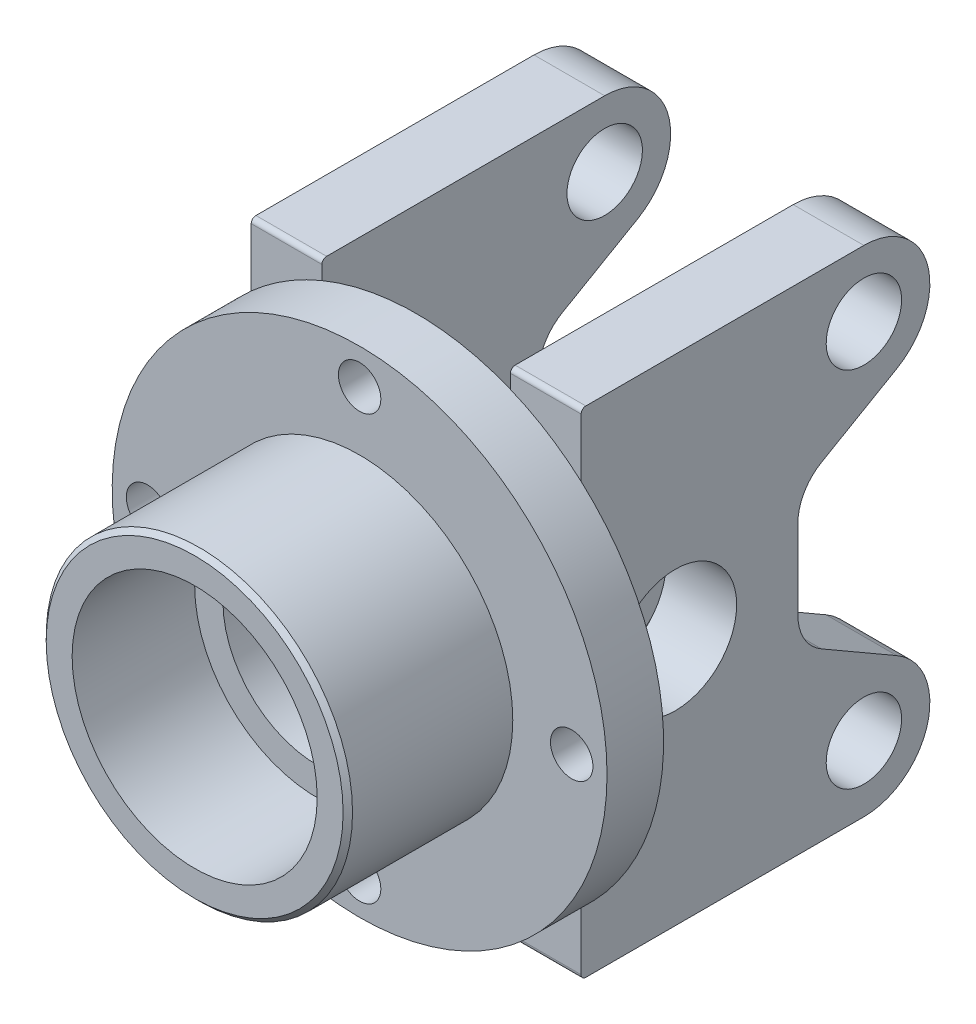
ISO-10303-21;
HEADER;
FILE_DESCRIPTION(('STEP AP214'),'2;1');
FILE_NAME('part.step','',(''),(''),'','','');
FILE_SCHEMA(('AUTOMOTIVE_DESIGN { 1 0 10303 214 1 1 1 1 }'));
ENDSEC;
DATA;
#1=APPLICATION_CONTEXT('core data for automotive mechanical design processes');
#2=APPLICATION_PROTOCOL_DEFINITION('international standard','automotive_design',2000,#1);
#3=PRODUCT_CONTEXT('',#1,'mechanical');
#4=PRODUCT('Part','Part','',(#3));
#5=PRODUCT_RELATED_PRODUCT_CATEGORY('part','',(#4));
#6=PRODUCT_DEFINITION_FORMATION('','',#4);
#7=PRODUCT_DEFINITION_CONTEXT('part definition',#1,'design');
#8=PRODUCT_DEFINITION('design','',#6,#7);
#9=PRODUCT_DEFINITION_SHAPE('','',#8);
#10=(LENGTH_UNIT() NAMED_UNIT(*) SI_UNIT(.MILLI.,.METRE.));
#11=(NAMED_UNIT(*) PLANE_ANGLE_UNIT() SI_UNIT($,.RADIAN.));
#12=(NAMED_UNIT(*) SI_UNIT($,.STERADIAN.) SOLID_ANGLE_UNIT());
#13=UNCERTAINTY_MEASURE_WITH_UNIT(LENGTH_MEASURE(1.E-05),#10,'distance_accuracy_value','');
#14=(GEOMETRIC_REPRESENTATION_CONTEXT(3) GLOBAL_UNCERTAINTY_ASSIGNED_CONTEXT((#13)) GLOBAL_UNIT_ASSIGNED_CONTEXT((#10,
#11,#12)) REPRESENTATION_CONTEXT('',''));
#15=CARTESIAN_POINT('',(0.,0.,0.));
#16=DIRECTION('',(0.,0.,1.));
#17=DIRECTION('',(1.,0.,0.));
#18=AXIS2_PLACEMENT_3D('',#15,#16,#17);
#19=CARTESIAN_POINT('',(35.,-52.5,-46.));
#20=DIRECTION('',(0.,1.,0.));
#21=DIRECTION('',(0.,0.,1.));
#22=AXIS2_PLACEMENT_3D('',#19,#20,#21);
#23=PLANE('',#22);
#24=DIRECTION('',(1.,0.,0.));
#25=VECTOR('',#24,1.);
#26=CARTESIAN_POINT('',(-32.1723616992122,-52.5,-60.));
#27=LINE('',#26,#25);
#28=CARTESIAN_POINT('',(-35.,-52.5,-60.));
#29=VERTEX_POINT('',#28);
#30=CARTESIAN_POINT('',(-20.,-52.5,-60.));
#31=VERTEX_POINT('',#30);
#32=EDGE_CURVE('E258',#29,#31,#27,.T.);
#33=ORIENTED_EDGE('',*,*,#32,.T.);
#34=DIRECTION('',(0.,0.,1.));
#35=VECTOR('',#34,1.);
#36=CARTESIAN_POINT('',(-20.,-52.5,-46.));
#37=LINE('',#36,#35);
#38=CARTESIAN_POINT('',(-20.,-52.5,-1.));
#39=VERTEX_POINT('',#38);
#40=EDGE_CURVE('E315',#31,#39,#37,.T.);
#41=ORIENTED_EDGE('',*,*,#40,.T.);
#42=DIRECTION('',(-1.,0.,0.));
#43=VECTOR('',#42,1.);
#44=CARTESIAN_POINT('',(-35.,-52.5,-1.));
#45=LINE('',#44,#43);
#46=CARTESIAN_POINT('',(-35.,-52.5,-1.));
#47=VERTEX_POINT('',#46);
#48=EDGE_CURVE('E391',#39,#47,#45,.T.);
#49=ORIENTED_EDGE('',*,*,#48,.T.);
#50=DIRECTION('',(0.,0.,1.));
#51=VECTOR('',#50,1.);
#52=CARTESIAN_POINT('',(-35.,-52.5,-46.));
#53=LINE('',#52,#51);
#54=EDGE_CURVE('E314',#29,#47,#53,.T.);
#55=ORIENTED_EDGE('',*,*,#54,.F.);
#56=EDGE_LOOP('',(#33,#41,#49,#55));
#57=FACE_BOUND('',#56,.T.);
#58=ADVANCED_FACE('F44',(#57),#23,.F.);
#59=CARTESIAN_POINT('',(35.,52.5,-46.));
#60=DIRECTION('',(0.,-1.,0.));
#61=DIRECTION('',(0.,0.,-1.));
#62=AXIS2_PLACEMENT_3D('',#59,#60,#61);
#63=PLANE('',#62);
#64=DIRECTION('',(0.,0.,1.));
#65=VECTOR('',#64,1.);
#66=CARTESIAN_POINT('',(-20.,52.5,-46.));
#67=LINE('',#66,#65);
#68=CARTESIAN_POINT('',(-20.,52.5,-60.));
#69=VERTEX_POINT('',#68);
#70=CARTESIAN_POINT('',(-20.,52.5,-1.));
#71=VERTEX_POINT('',#70);
#72=EDGE_CURVE('E307',#69,#71,#67,.T.);
#73=ORIENTED_EDGE('',*,*,#72,.F.);
#74=DIRECTION('',(1.,0.,0.));
#75=VECTOR('',#74,1.);
#76=CARTESIAN_POINT('',(-32.1723616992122,52.5,-60.));
#77=LINE('',#76,#75);
#78=CARTESIAN_POINT('',(-35.,52.5,-60.));
#79=VERTEX_POINT('',#78);
#80=EDGE_CURVE('E493',#79,#69,#77,.T.);
#81=ORIENTED_EDGE('',*,*,#80,.F.);
#82=DIRECTION('',(0.,0.,1.));
#83=VECTOR('',#82,1.);
#84=CARTESIAN_POINT('',(-35.,52.5,-46.));
#85=LINE('',#84,#83);
#86=CARTESIAN_POINT('',(-35.,52.5,-1.));
#87=VERTEX_POINT('',#86);
#88=EDGE_CURVE('E287',#79,#87,#85,.T.);
#89=ORIENTED_EDGE('',*,*,#88,.T.);
#90=DIRECTION('',(1.,0.,0.));
#91=VECTOR('',#90,1.);
#92=CARTESIAN_POINT('',(-20.,52.5,-1.));
#93=LINE('',#92,#91);
#94=EDGE_CURVE('E407',#87,#71,#93,.T.);
#95=ORIENTED_EDGE('',*,*,#94,.T.);
#96=EDGE_LOOP('',(#73,#81,#89,#95));
#97=FACE_BOUND('',#96,.T.);
#98=ADVANCED_FACE('F438',(#97),#63,.F.);
#99=CARTESIAN_POINT('',(-32.1723616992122,-38.5,-60.));
#100=DIRECTION('',(1.,0.,0.));
#101=DIRECTION('',(0.,1.,0.));
#102=AXIS2_PLACEMENT_3D('',#99,#100,#101);
#103=CYLINDRICAL_SURFACE('',#102,14.);
#104=DIRECTION('',(1.,0.,0.));
#105=VECTOR('',#104,1.);
#106=CARTESIAN_POINT('',(-32.1723616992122,-26.3756443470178,-67.));
#107=LINE('',#106,#105);
#108=CARTESIAN_POINT('',(-35.,-26.3756443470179,-67.));
#109=VERTEX_POINT('',#108);
#110=CARTESIAN_POINT('',(-20.,-26.3756443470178,-67.));
#111=VERTEX_POINT('',#110);
#112=EDGE_CURVE('E275',#109,#111,#107,.T.);
#113=ORIENTED_EDGE('',*,*,#112,.T.);
#114=CARTESIAN_POINT('',(-20.,-38.5,-60.));
#115=DIRECTION('',(-1.,0.,0.));
#116=DIRECTION('',(0.,0.,1.));
#117=AXIS2_PLACEMENT_3D('',#114,#115,#116);
#118=CIRCLE('',#117,14.);
#119=EDGE_CURVE('E547',#111,#31,#118,.T.);
#120=ORIENTED_EDGE('',*,*,#119,.T.);
#121=ORIENTED_EDGE('',*,*,#32,.F.);
#122=CARTESIAN_POINT('',(-35.,-38.5,-60.));
#123=DIRECTION('',(1.,0.,0.));
#124=DIRECTION('',(0.,1.,0.));
#125=AXIS2_PLACEMENT_3D('',#122,#123,#124);
#126=CIRCLE('',#125,14.);
#127=EDGE_CURVE('E507',#109,#29,#126,.F.);
#128=ORIENTED_EDGE('',*,*,#127,.F.);
#129=EDGE_LOOP('',(#113,#120,#121,#128));
#130=FACE_BOUND('',#129,.T.);
#131=ADVANCED_FACE('F435',(#130),#103,.T.);
#132=CARTESIAN_POINT('',(-32.1723616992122,-8.4777860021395,-56.));
#133=DIRECTION('',(1.,0.,0.));
#134=DIRECTION('',(0.,1.,0.));
#135=AXIS2_PLACEMENT_3D('',#132,#133,#134);
#136=CYLINDRICAL_SURFACE('',#135,10.);
#137=DIRECTION('',(-1.,0.,0.));
#138=VECTOR('',#137,1.);
#139=CARTESIAN_POINT('',(72.1723616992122,-8.4777860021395,-46.));
#140=LINE('',#139,#138);
#141=CARTESIAN_POINT('',(-20.,-8.47778600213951,-46.));
#142=VERTEX_POINT('',#141);
#143=CARTESIAN_POINT('',(-35.,-8.47778600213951,-46.));
#144=VERTEX_POINT('',#143);
#145=EDGE_CURVE('E503',#142,#144,#140,.T.);
#146=ORIENTED_EDGE('',*,*,#145,.F.);
#147=CARTESIAN_POINT('',(-20.,-8.47778600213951,-56.));
#148=DIRECTION('',(-1.,0.,0.));
#149=DIRECTION('',(0.,0.,1.));
#150=AXIS2_PLACEMENT_3D('',#147,#148,#149);
#151=CIRCLE('',#150,10.);
#152=CARTESIAN_POINT('',(-20.,-17.1380400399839,-51.));
#153=VERTEX_POINT('',#152);
#154=EDGE_CURVE('E62',#142,#153,#151,.F.);
#155=ORIENTED_EDGE('',*,*,#154,.T.);
#156=DIRECTION('',(1.,0.,0.));
#157=VECTOR('',#156,1.);
#158=CARTESIAN_POINT('',(-32.1723616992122,-17.1380400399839,-51.));
#159=LINE('',#158,#157);
#160=CARTESIAN_POINT('',(-35.,-17.1380400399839,-51.));
#161=VERTEX_POINT('',#160);
#162=EDGE_CURVE('E269',#161,#153,#159,.T.);
#163=ORIENTED_EDGE('',*,*,#162,.F.);
#164=CARTESIAN_POINT('',(-35.,-8.47778600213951,-56.));
#165=DIRECTION('',(1.,0.,0.));
#166=DIRECTION('',(0.,1.,0.));
#167=AXIS2_PLACEMENT_3D('',#164,#165,#166);
#168=CIRCLE('',#167,10.);
#169=EDGE_CURVE('E512',#144,#161,#168,.T.);
#170=ORIENTED_EDGE('',*,*,#169,.F.);
#171=EDGE_LOOP('',(#146,#155,#163,#170));
#172=FACE_BOUND('',#171,.T.);
#173=ADVANCED_FACE('F715',(#172),#136,.F.);
#174=CARTESIAN_POINT('',(-32.1723616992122,9.23011776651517,-5.32901097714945));
#175=DIRECTION('',(0.,0.86602540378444,-0.499999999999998));
#176=DIRECTION('',(0.,0.499999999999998,0.86602540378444));
#177=AXIS2_PLACEMENT_3D('',#174,#175,#176);
#178=PLANE('',#177);
#179=DIRECTION('',(0.,0.499999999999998,0.86602540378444));
#180=VECTOR('',#179,1.);
#181=CARTESIAN_POINT('',(-20.,9.23011776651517,-5.32901097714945));
#182=LINE('',#181,#180);
#183=EDGE_CURVE('E550',#111,#153,#182,.T.);
#184=ORIENTED_EDGE('',*,*,#183,.F.);
#185=ORIENTED_EDGE('',*,*,#112,.F.);
#186=DIRECTION('',(0.,0.499999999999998,0.86602540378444));
#187=VECTOR('',#186,1.);
#188=CARTESIAN_POINT('',(-35.,9.23011776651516,-5.32901097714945));
#189=LINE('',#188,#187);
#190=EDGE_CURVE('E510',#109,#161,#189,.T.);
#191=ORIENTED_EDGE('',*,*,#190,.T.);
#192=ORIENTED_EDGE('',*,*,#162,.T.);
#193=EDGE_LOOP('',(#184,#185,#191,#192));
#194=FACE_BOUND('',#193,.T.);
#195=ADVANCED_FACE('F713',(#194),#178,.T.);
#196=CARTESIAN_POINT('',(-32.1723616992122,-38.5,-60.));
#197=DIRECTION('',(1.,0.,0.));
#198=DIRECTION('',(0.,1.,0.));
#199=AXIS2_PLACEMENT_3D('',#196,#197,#198);
#200=CYLINDRICAL_SURFACE('',#199,8.00000000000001);
#201=CARTESIAN_POINT('',(-20.,-38.5,-60.));
#202=DIRECTION('',(-1.,0.,0.));
#203=DIRECTION('',(0.,0.,1.));
#204=AXIS2_PLACEMENT_3D('',#201,#202,#203);
#205=CIRCLE('',#204,8.00000000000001);
#206=CARTESIAN_POINT('',(-20.,-38.5,-52.));
#207=VERTEX_POINT('',#206);
#208=EDGE_CURVE('E520',#207,#207,#205,.T.);
#209=ORIENTED_EDGE('',*,*,#208,.F.);
#210=EDGE_LOOP('',(#209));
#211=FACE_BOUND('',#210,.T.);
#212=CARTESIAN_POINT('',(-35.,-38.5,-60.));
#213=DIRECTION('',(1.,0.,0.));
#214=DIRECTION('',(0.,1.,0.));
#215=AXIS2_PLACEMENT_3D('',#212,#213,#214);
#216=CIRCLE('',#215,8.00000000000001);
#217=CARTESIAN_POINT('',(-35.,-30.5,-60.));
#218=VERTEX_POINT('',#217);
#219=EDGE_CURVE('E506',#218,#218,#216,.F.);
#220=ORIENTED_EDGE('',*,*,#219,.T.);
#221=EDGE_LOOP('',(#220));
#222=FACE_BOUND('',#221,.T.);
#223=ADVANCED_FACE('F949',(#211,#222),#200,.F.);
#224=CARTESIAN_POINT('',(-32.1723616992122,38.5,-60.));
#225=DIRECTION('',(1.,0.,0.));
#226=DIRECTION('',(0.,1.,0.));
#227=AXIS2_PLACEMENT_3D('',#224,#225,#226);
#228=CYLINDRICAL_SURFACE('',#227,14.);
#229=CARTESIAN_POINT('',(-20.,38.5,-60.));
#230=DIRECTION('',(-1.,0.,0.));
#231=DIRECTION('',(0.,0.,1.));
#232=AXIS2_PLACEMENT_3D('',#229,#230,#231);
#233=CIRCLE('',#232,14.);
#234=CARTESIAN_POINT('',(-20.,26.3756443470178,-67.));
#235=VERTEX_POINT('',#234);
#236=EDGE_CURVE('E536',#235,#69,#233,.F.);
#237=ORIENTED_EDGE('',*,*,#236,.F.);
#238=DIRECTION('',(1.,0.,0.));
#239=VECTOR('',#238,1.);
#240=CARTESIAN_POINT('',(-32.1723616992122,26.3756443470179,-67.));
#241=LINE('',#240,#239);
#242=CARTESIAN_POINT('',(-35.,26.3756443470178,-67.));
#243=VERTEX_POINT('',#242);
#244=EDGE_CURVE('E488',#243,#235,#241,.T.);
#245=ORIENTED_EDGE('',*,*,#244,.F.);
#246=CARTESIAN_POINT('',(-35.,38.5,-60.));
#247=DIRECTION('',(1.,0.,0.));
#248=DIRECTION('',(0.,1.,0.));
#249=AXIS2_PLACEMENT_3D('',#246,#247,#248);
#250=CIRCLE('',#249,14.);
#251=EDGE_CURVE('E528',#243,#79,#250,.T.);
#252=ORIENTED_EDGE('',*,*,#251,.T.);
#253=ORIENTED_EDGE('',*,*,#80,.T.);
#254=EDGE_LOOP('',(#237,#245,#252,#253));
#255=FACE_BOUND('',#254,.T.);
#256=ADVANCED_FACE('F707',(#255),#228,.T.);
#257=CARTESIAN_POINT('',(-32.1723616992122,-9.23011776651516,-5.32901097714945));
#258=DIRECTION('',(0.,0.86602540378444,0.499999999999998));
#259=DIRECTION('',(0.,-0.499999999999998,0.86602540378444));
#260=AXIS2_PLACEMENT_3D('',#257,#258,#259);
#261=PLANE('',#260);
#262=ORIENTED_EDGE('',*,*,#244,.T.);
#263=DIRECTION('',(0.,-0.499999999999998,0.86602540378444));
#264=VECTOR('',#263,1.);
#265=CARTESIAN_POINT('',(-20.,-9.23011776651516,-5.32901097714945));
#266=LINE('',#265,#264);
#267=CARTESIAN_POINT('',(-20.,17.1380400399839,-51.));
#268=VERTEX_POINT('',#267);
#269=EDGE_CURVE('E545',#235,#268,#266,.T.);
#270=ORIENTED_EDGE('',*,*,#269,.T.);
#271=DIRECTION('',(1.,0.,0.));
#272=VECTOR('',#271,1.);
#273=CARTESIAN_POINT('',(-32.1723616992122,17.1380400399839,-51.));
#274=LINE('',#273,#272);
#275=CARTESIAN_POINT('',(-35.,17.1380400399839,-51.));
#276=VERTEX_POINT('',#275);
#277=EDGE_CURVE('E481',#276,#268,#274,.T.);
#278=ORIENTED_EDGE('',*,*,#277,.F.);
#279=DIRECTION('',(0.,-0.499999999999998,0.86602540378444));
#280=VECTOR('',#279,1.);
#281=CARTESIAN_POINT('',(-35.,-9.23011776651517,-5.32901097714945));
#282=LINE('',#281,#280);
#283=EDGE_CURVE('E526',#243,#276,#282,.T.);
#284=ORIENTED_EDGE('',*,*,#283,.F.);
#285=EDGE_LOOP('',(#262,#270,#278,#284));
#286=FACE_BOUND('',#285,.T.);
#287=ADVANCED_FACE('F604',(#286),#261,.F.);
#288=CARTESIAN_POINT('',(-32.1723616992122,38.5,-60.));
#289=DIRECTION('',(1.,0.,0.));
#290=DIRECTION('',(0.,1.,0.));
#291=AXIS2_PLACEMENT_3D('',#288,#289,#290);
#292=CYLINDRICAL_SURFACE('',#291,8.00000000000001);
#293=CARTESIAN_POINT('',(-20.,38.5,-60.));
#294=DIRECTION('',(-1.,0.,0.));
#295=DIRECTION('',(0.,0.,1.));
#296=AXIS2_PLACEMENT_3D('',#293,#294,#295);
#297=CIRCLE('',#296,8.00000000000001);
#298=CARTESIAN_POINT('',(-20.,38.5,-52.));
#299=VERTEX_POINT('',#298);
#300=EDGE_CURVE('E537',#299,#299,#297,.F.);
#301=ORIENTED_EDGE('',*,*,#300,.T.);
#302=EDGE_LOOP('',(#301));
#303=FACE_BOUND('',#302,.T.);
#304=CARTESIAN_POINT('',(-35.,38.5,-60.));
#305=DIRECTION('',(1.,0.,0.));
#306=DIRECTION('',(0.,1.,0.));
#307=AXIS2_PLACEMENT_3D('',#304,#305,#306);
#308=CIRCLE('',#307,8.00000000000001);
#309=CARTESIAN_POINT('',(-35.,46.5,-60.));
#310=VERTEX_POINT('',#309);
#311=EDGE_CURVE('E511',#310,#310,#308,.T.);
#312=ORIENTED_EDGE('',*,*,#311,.F.);
#313=EDGE_LOOP('',(#312));
#314=FACE_BOUND('',#313,.T.);
#315=ADVANCED_FACE('F591',(#303,#314),#292,.F.);
#316=CARTESIAN_POINT('',(-32.1723616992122,8.47778600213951,-56.));
#317=DIRECTION('',(1.,0.,0.));
#318=DIRECTION('',(0.,1.,0.));
#319=AXIS2_PLACEMENT_3D('',#316,#317,#318);
#320=CYLINDRICAL_SURFACE('',#319,10.);
#321=CARTESIAN_POINT('',(-20.,8.47778600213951,-56.));
#322=DIRECTION('',(-1.,0.,0.));
#323=DIRECTION('',(0.,0.,1.));
#324=AXIS2_PLACEMENT_3D('',#321,#322,#323);
#325=CIRCLE('',#324,10.);
#326=CARTESIAN_POINT('',(-20.,8.4777860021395,-46.));
#327=VERTEX_POINT('',#326);
#328=EDGE_CURVE('E542',#327,#268,#325,.T.);
#329=ORIENTED_EDGE('',*,*,#328,.F.);
#330=DIRECTION('',(-1.,0.,0.));
#331=VECTOR('',#330,1.);
#332=CARTESIAN_POINT('',(72.1723616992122,8.47778600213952,-46.));
#333=LINE('',#332,#331);
#334=CARTESIAN_POINT('',(-35.,8.4777860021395,-46.));
#335=VERTEX_POINT('',#334);
#336=EDGE_CURVE('E518',#327,#335,#333,.T.);
#337=ORIENTED_EDGE('',*,*,#336,.T.);
#338=CARTESIAN_POINT('',(-35.,8.4777860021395,-56.));
#339=DIRECTION('',(1.,0.,0.));
#340=DIRECTION('',(0.,1.,0.));
#341=AXIS2_PLACEMENT_3D('',#338,#339,#340);
#342=CIRCLE('',#341,10.);
#343=EDGE_CURVE('E521',#335,#276,#342,.F.);
#344=ORIENTED_EDGE('',*,*,#343,.T.);
#345=ORIENTED_EDGE('',*,*,#277,.T.);
#346=EDGE_LOOP('',(#329,#337,#344,#345));
#347=FACE_BOUND('',#346,.T.);
#348=ADVANCED_FACE('F583',(#347),#320,.F.);
#349=CARTESIAN_POINT('',(0.,0.,-46.));
#350=DIRECTION('',(0.,0.,1.));
#351=DIRECTION('',(1.,0.,0.));
#352=AXIS2_PLACEMENT_3D('',#349,#350,#351);
#353=PLANE('',#352);
#354=ORIENTED_EDGE('',*,*,#336,.F.);
#355=DIRECTION('',(0.,-1.,0.));
#356=VECTOR('',#355,1.);
#357=CARTESIAN_POINT('',(-20.,52.5,-46.));
#358=LINE('',#357,#356);
#359=EDGE_CURVE('E319',#327,#142,#358,.T.);
#360=ORIENTED_EDGE('',*,*,#359,.T.);
#361=ORIENTED_EDGE('',*,*,#145,.T.);
#362=DIRECTION('',(0.,1.,0.));
#363=VECTOR('',#362,1.);
#364=CARTESIAN_POINT('',(-35.,52.5,-46.));
#365=LINE('',#364,#363);
#366=EDGE_CURVE('E326',#144,#335,#365,.T.);
#367=ORIENTED_EDGE('',*,*,#366,.T.);
#368=EDGE_LOOP('',(#354,#360,#361,#367));
#369=FACE_BOUND('',#368,.T.);
#370=ADVANCED_FACE('F593',(#369),#353,.F.);
#371=CARTESIAN_POINT('',(0.,0.,0.));
#372=DIRECTION('',(0.,0.,1.));
#373=DIRECTION('',(1.,0.,0.));
#374=AXIS2_PLACEMENT_3D('',#371,#372,#373);
#375=PLANE('',#374);
#376=CARTESIAN_POINT('',(45.,4.71349980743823E-13,0.));
#377=DIRECTION('',(0.,0.,-1.));
#378=DIRECTION('',(-1.,0.,0.));
#379=AXIS2_PLACEMENT_3D('',#376,#377,#378);
#380=CIRCLE('',#379,4.5);
#381=CARTESIAN_POINT('',(40.5,4.71349980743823E-13,0.));
#382=VERTEX_POINT('',#381);
#383=EDGE_CURVE('E306',#382,#382,#380,.T.);
#384=ORIENTED_EDGE('',*,*,#383,.F.);
#385=EDGE_LOOP('',(#384));
#386=FACE_BOUND('',#385,.T.);
#387=DIRECTION('',(0.,-1.,0.));
#388=VECTOR('',#387,1.);
#389=CARTESIAN_POINT('',(35.,52.5,0.));
#390=LINE('',#389,#388);
#391=CARTESIAN_POINT('',(35.,39.1311896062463,0.));
#392=VERTEX_POINT('',#391);
#393=CARTESIAN_POINT('',(35.,-39.1311896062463,0.));
#394=VERTEX_POINT('',#393);
#395=EDGE_CURVE('E295',#392,#394,#390,.T.);
#396=ORIENTED_EDGE('',*,*,#395,.F.);
#397=CARTESIAN_POINT('',(0.,0.,0.));
#398=DIRECTION('',(0.,0.,1.));
#399=DIRECTION('',(1.,0.,0.));
#400=AXIS2_PLACEMENT_3D('',#397,#398,#399);
#401=CIRCLE('',#400,52.5);
#402=EDGE_CURVE('E367',#394,#392,#401,.T.);
#403=ORIENTED_EDGE('',*,*,#402,.F.);
#404=EDGE_LOOP('',(#396,#403));
#405=FACE_BOUND('',#404,.T.);
#406=ADVANCED_FACE('F598',(#386,#405),#375,.F.);
#407=CARTESIAN_POINT('',(3.14233320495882E-13,-45.,0.));
#408=DIRECTION('',(0.,0.,-1.));
#409=DIRECTION('',(-1.,0.,0.));
#410=AXIS2_PLACEMENT_3D('',#407,#408,#409);
#411=CIRCLE('',#410,4.5);
#412=CARTESIAN_POINT('',(-4.49999999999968,-45.,0.));
#413=VERTEX_POINT('',#412);
#414=EDGE_CURVE('E340',#413,#413,#411,.T.);
#415=ORIENTED_EDGE('',*,*,#414,.F.);
#416=EDGE_LOOP('',(#415));
#417=FACE_BOUND('',#416,.T.);
#418=DIRECTION('',(0.,1.,0.));
#419=VECTOR('',#418,1.);
#420=CARTESIAN_POINT('',(20.,52.5,0.));
#421=LINE('',#420,#419);
#422=CARTESIAN_POINT('',(20.,-48.541219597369,0.));
#423=VERTEX_POINT('',#422);
#424=CARTESIAN_POINT('',(20.,0.,0.));
#425=VERTEX_POINT('',#424);
#426=EDGE_CURVE('E750',#423,#425,#421,.T.);
#427=ORIENTED_EDGE('',*,*,#426,.F.);
#428=CARTESIAN_POINT('',(-20.,-48.541219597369,0.));
#429=VERTEX_POINT('',#428);
#430=EDGE_CURVE('E728',#429,#423,#401,.T.);
#431=ORIENTED_EDGE('',*,*,#430,.F.);
#432=DIRECTION('',(0.,-1.,0.));
#433=VECTOR('',#432,1.);
#434=CARTESIAN_POINT('',(-20.,52.5,0.));
#435=LINE('',#434,#433);
#436=CARTESIAN_POINT('',(-20.,0.,0.));
#437=VERTEX_POINT('',#436);
#438=EDGE_CURVE('E324',#437,#429,#435,.T.);
#439=ORIENTED_EDGE('',*,*,#438,.F.);
#440=CARTESIAN_POINT('',(0.,0.,0.));
#441=DIRECTION('',(0.,0.,-1.));
#442=DIRECTION('',(-1.,0.,0.));
#443=AXIS2_PLACEMENT_3D('',#440,#441,#442);
#444=CIRCLE('',#443,20.);
#445=EDGE_CURVE('E354',#425,#437,#444,.T.);
#446=ORIENTED_EDGE('',*,*,#445,.F.);
#447=EDGE_LOOP('',(#427,#431,#439,#446));
#448=FACE_BOUND('',#447,.T.);
#449=ADVANCED_FACE('F676',(#417,#448),#375,.F.);
#450=CARTESIAN_POINT('',(0.,45.,0.));
#451=DIRECTION('',(0.,0.,-1.));
#452=DIRECTION('',(-1.,0.,0.));
#453=AXIS2_PLACEMENT_3D('',#450,#451,#452);
#454=CIRCLE('',#453,4.5);
#455=CARTESIAN_POINT('',(-4.5,45.,0.));
#456=VERTEX_POINT('',#455);
#457=EDGE_CURVE('E327',#456,#456,#454,.T.);
#458=ORIENTED_EDGE('',*,*,#457,.F.);
#459=EDGE_LOOP('',(#458));
#460=FACE_BOUND('',#459,.T.);
#461=CARTESIAN_POINT('',(20.,48.541219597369,0.));
#462=VERTEX_POINT('',#461);
#463=EDGE_CURVE('E298',#425,#462,#421,.T.);
#464=ORIENTED_EDGE('',*,*,#463,.F.);
#465=EDGE_CURVE('E356',#437,#425,#444,.T.);
#466=ORIENTED_EDGE('',*,*,#465,.F.);
#467=CARTESIAN_POINT('',(-20.,48.541219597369,0.));
#468=VERTEX_POINT('',#467);
#469=EDGE_CURVE('E752',#468,#437,#435,.T.);
#470=ORIENTED_EDGE('',*,*,#469,.F.);
#471=EDGE_CURVE('E374',#462,#468,#401,.T.);
#472=ORIENTED_EDGE('',*,*,#471,.F.);
#473=EDGE_LOOP('',(#464,#466,#470,#472));
#474=FACE_BOUND('',#473,.T.);
#475=ADVANCED_FACE('F761',(#460,#474),#375,.F.);
#476=CARTESIAN_POINT('',(-45.,-1.57116660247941E-13,0.));
#477=DIRECTION('',(0.,0.,-1.));
#478=DIRECTION('',(-1.,0.,0.));
#479=AXIS2_PLACEMENT_3D('',#476,#477,#478);
#480=CIRCLE('',#479,4.5);
#481=CARTESIAN_POINT('',(-49.5,-1.57116660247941E-13,0.));
#482=VERTEX_POINT('',#481);
#483=EDGE_CURVE('E333',#482,#482,#480,.T.);
#484=ORIENTED_EDGE('',*,*,#483,.F.);
#485=EDGE_LOOP('',(#484));
#486=FACE_BOUND('',#485,.T.);
#487=DIRECTION('',(0.,1.,0.));
#488=VECTOR('',#487,1.);
#489=CARTESIAN_POINT('',(-35.,52.5,0.));
#490=LINE('',#489,#488);
#491=CARTESIAN_POINT('',(-35.,-39.1311896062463,0.));
#492=VERTEX_POINT('',#491);
#493=CARTESIAN_POINT('',(-35.,39.1311896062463,0.));
#494=VERTEX_POINT('',#493);
#495=EDGE_CURVE('E328',#492,#494,#490,.T.);
#496=ORIENTED_EDGE('',*,*,#495,.F.);
#497=EDGE_CURVE('E729',#494,#492,#401,.T.);
#498=ORIENTED_EDGE('',*,*,#497,.F.);
#499=EDGE_LOOP('',(#496,#498));
#500=FACE_BOUND('',#499,.T.);
#501=ADVANCED_FACE('F679',(#486,#500),#375,.F.);
#502=CARTESIAN_POINT('',(0.,0.,12.));
#503=DIRECTION('',(0.,0.,-1.));
#504=DIRECTION('',(-1.,0.,0.));
#505=AXIS2_PLACEMENT_3D('',#502,#503,#504);
#506=CYLINDRICAL_SURFACE('',#505,52.5);
#507=CARTESIAN_POINT('',(0.,0.,12.));
#508=DIRECTION('',(0.,0.,1.));
#509=DIRECTION('',(1.,0.,0.));
#510=AXIS2_PLACEMENT_3D('',#507,#508,#509);
#511=CIRCLE('',#510,52.5);
#512=CARTESIAN_POINT('',(52.5,0.,12.));
#513=VERTEX_POINT('',#512);
#514=EDGE_CURVE('E369',#513,#513,#511,.T.);
#515=ORIENTED_EDGE('',*,*,#514,.F.);
#516=EDGE_LOOP('',(#515));
#517=FACE_BOUND('',#516,.T.);
#518=EDGE_CURVE('E373',#392,#462,#401,.T.);
#519=ORIENTED_EDGE('',*,*,#518,.T.);
#520=ORIENTED_EDGE('',*,*,#471,.T.);
#521=EDGE_CURVE('E732',#468,#494,#401,.T.);
#522=ORIENTED_EDGE('',*,*,#521,.T.);
#523=ORIENTED_EDGE('',*,*,#497,.T.);
#524=EDGE_CURVE('E723',#492,#429,#401,.T.);
#525=ORIENTED_EDGE('',*,*,#524,.T.);
#526=ORIENTED_EDGE('',*,*,#430,.T.);
#527=EDGE_CURVE('E735',#423,#394,#401,.T.);
#528=ORIENTED_EDGE('',*,*,#527,.T.);
#529=ORIENTED_EDGE('',*,*,#402,.T.);
#530=EDGE_LOOP('',(#519,#520,#522,#523,#525,#526,#528,#529));
#531=FACE_BOUND('',#530,.T.);
#532=ADVANCED_FACE('F675',(#517,#531),#506,.T.);
#533=CARTESIAN_POINT('',(0.,0.,12.));
#534=DIRECTION('',(0.,0.,1.));
#535=DIRECTION('',(1.,0.,0.));
#536=AXIS2_PLACEMENT_3D('',#533,#534,#535);
#537=PLANE('',#536);
#538=CARTESIAN_POINT('',(0.,45.,12.));
#539=DIRECTION('',(0.,0.,1.));
#540=DIRECTION('',(1.,0.,0.));
#541=AXIS2_PLACEMENT_3D('',#538,#539,#540);
#542=CIRCLE('',#541,4.5);
#543=CARTESIAN_POINT('',(4.5,45.,12.));
#544=VERTEX_POINT('',#543);
#545=EDGE_CURVE('E347',#544,#544,#542,.T.);
#546=ORIENTED_EDGE('',*,*,#545,.F.);
#547=EDGE_LOOP('',(#546));
#548=FACE_BOUND('',#547,.T.);
#549=CARTESIAN_POINT('',(-45.,-1.57116660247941E-13,12.));
#550=DIRECTION('',(0.,0.,1.));
#551=DIRECTION('',(1.,0.,0.));
#552=AXIS2_PLACEMENT_3D('',#549,#550,#551);
#553=CIRCLE('',#552,4.5);
#554=CARTESIAN_POINT('',(-40.5,-1.57116660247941E-13,12.));
#555=VERTEX_POINT('',#554);
#556=EDGE_CURVE('E350',#555,#555,#553,.T.);
#557=ORIENTED_EDGE('',*,*,#556,.F.);
#558=EDGE_LOOP('',(#557));
#559=FACE_BOUND('',#558,.T.);
#560=CARTESIAN_POINT('',(3.14233320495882E-13,-45.,12.));
#561=DIRECTION('',(0.,0.,1.));
#562=DIRECTION('',(1.,0.,0.));
#563=AXIS2_PLACEMENT_3D('',#560,#561,#562);
#564=CIRCLE('',#563,4.5);
#565=CARTESIAN_POINT('',(4.50000000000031,-45.,12.));
#566=VERTEX_POINT('',#565);
#567=EDGE_CURVE('E341',#566,#566,#564,.T.);
#568=ORIENTED_EDGE('',*,*,#567,.F.);
#569=EDGE_LOOP('',(#568));
#570=FACE_BOUND('',#569,.T.);
#571=CARTESIAN_POINT('',(45.,4.71349980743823E-13,12.));
#572=DIRECTION('',(0.,0.,1.));
#573=DIRECTION('',(1.,0.,0.));
#574=AXIS2_PLACEMENT_3D('',#571,#572,#573);
#575=CIRCLE('',#574,4.5);
#576=CARTESIAN_POINT('',(49.5,4.71349980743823E-13,12.));
#577=VERTEX_POINT('',#576);
#578=EDGE_CURVE('E334',#577,#577,#575,.T.);
#579=ORIENTED_EDGE('',*,*,#578,.F.);
#580=EDGE_LOOP('',(#579));
#581=FACE_BOUND('',#580,.T.);
#582=CARTESIAN_POINT('',(0.,0.,12.));
#583=DIRECTION('',(0.,0.,1.));
#584=DIRECTION('',(1.,0.,0.));
#585=AXIS2_PLACEMENT_3D('',#582,#583,#584);
#586=CIRCLE('',#585,32.5);
#587=CARTESIAN_POINT('',(32.5,0.,12.));
#588=VERTEX_POINT('',#587);
#589=EDGE_CURVE('E364',#588,#588,#586,.F.);
#590=ORIENTED_EDGE('',*,*,#589,.T.);
#591=EDGE_LOOP('',(#590));
#592=FACE_BOUND('',#591,.T.);
#593=ORIENTED_EDGE('',*,*,#514,.T.);
#594=EDGE_LOOP('',(#593));
#595=FACE_BOUND('',#594,.T.);
#596=ADVANCED_FACE('F669',(#548,#559,#570,#581,#592,#595),#537,.T.);
#597=CARTESIAN_POINT('',(0.,0.,47.));
#598=DIRECTION('',(0.,0.,-1.));
#599=DIRECTION('',(-1.,0.,0.));
#600=AXIS2_PLACEMENT_3D('',#597,#598,#599);
#601=CYLINDRICAL_SURFACE('',#600,32.5);
#602=CARTESIAN_POINT('',(0.,0.,46.));
#603=DIRECTION('',(0.,0.,1.));
#604=DIRECTION('',(1.,0.,0.));
#605=AXIS2_PLACEMENT_3D('',#602,#603,#604);
#606=CIRCLE('',#605,32.5);
#607=CARTESIAN_POINT('',(32.5,0.,46.));
#608=VERTEX_POINT('',#607);
#609=EDGE_CURVE('E11',#608,#608,#606,.F.);
#610=ORIENTED_EDGE('',*,*,#609,.T.);
#611=EDGE_LOOP('',(#610));
#612=FACE_BOUND('',#611,.T.);
#613=ORIENTED_EDGE('',*,*,#589,.F.);
#614=EDGE_LOOP('',(#613));
#615=FACE_BOUND('',#614,.T.);
#616=ADVANCED_FACE('F663',(#612,#615),#601,.T.);
#617=CARTESIAN_POINT('',(0.,0.,47.));
#618=DIRECTION('',(0.,0.,1.));
#619=DIRECTION('',(1.,0.,0.));
#620=AXIS2_PLACEMENT_3D('',#617,#618,#619);
#621=PLANE('',#620);
#622=CARTESIAN_POINT('',(0.,0.,47.));
#623=DIRECTION('',(0.,0.,1.));
#624=DIRECTION('',(1.,0.,0.));
#625=AXIS2_PLACEMENT_3D('',#622,#623,#624);
#626=CIRCLE('',#625,31.5);
#627=CARTESIAN_POINT('',(31.5,0.,47.));
#628=VERTEX_POINT('',#627);
#629=EDGE_CURVE('E53',#628,#628,#626,.T.);
#630=ORIENTED_EDGE('',*,*,#629,.T.);
#631=EDGE_LOOP('',(#630));
#632=FACE_BOUND('',#631,.T.);
#633=CARTESIAN_POINT('',(0.,0.,47.));
#634=DIRECTION('',(0.,0.,1.));
#635=DIRECTION('',(1.,0.,0.));
#636=AXIS2_PLACEMENT_3D('',#633,#634,#635);
#637=CIRCLE('',#636,26.);
#638=CARTESIAN_POINT('',(26.,0.,47.));
#639=VERTEX_POINT('',#638);
#640=EDGE_CURVE('E357',#639,#639,#637,.T.);
#641=ORIENTED_EDGE('',*,*,#640,.F.);
#642=EDGE_LOOP('',(#641));
#643=FACE_BOUND('',#642,.T.);
#644=ADVANCED_FACE('F419',(#632,#643),#621,.T.);
#645=CARTESIAN_POINT('',(0.,0.,21.));
#646=DIRECTION('',(0.,0.,1.));
#647=DIRECTION('',(1.,0.,0.));
#648=AXIS2_PLACEMENT_3D('',#645,#646,#647);
#649=CYLINDRICAL_SURFACE('',#648,26.);
#650=CARTESIAN_POINT('',(0.,0.,21.));
#651=DIRECTION('',(0.,0.,1.));
#652=DIRECTION('',(1.,0.,0.));
#653=AXIS2_PLACEMENT_3D('',#650,#651,#652);
#654=CIRCLE('',#653,26.);
#655=CARTESIAN_POINT('',(26.,0.,21.));
#656=VERTEX_POINT('',#655);
#657=EDGE_CURVE('E363',#656,#656,#654,.T.);
#658=CARTESIAN_POINT('',(26.,0.,21.));
#659=CARTESIAN_POINT('',(26.,0.,21.2708333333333));
#660=CARTESIAN_POINT('',(26.,0.,21.5416666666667));
#661=CARTESIAN_POINT('',(26.,0.,22.0833333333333));
#662=CARTESIAN_POINT('',(26.,0.,22.3541666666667));
#663=CARTESIAN_POINT('',(26.,0.,22.8958333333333));
#664=CARTESIAN_POINT('',(26.,0.,23.1666666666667));
#665=CARTESIAN_POINT('',(26.,0.,23.7083333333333));
#666=CARTESIAN_POINT('',(26.,0.,23.9791666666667));
#667=CARTESIAN_POINT('',(26.,0.,24.5208333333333));
#668=CARTESIAN_POINT('',(26.,0.,24.7916666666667));
#669=CARTESIAN_POINT('',(26.,0.,25.3333333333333));
#670=CARTESIAN_POINT('',(26.,0.,25.6041666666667));
#671=CARTESIAN_POINT('',(26.,0.,26.1458333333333));
#672=CARTESIAN_POINT('',(26.,0.,26.4166666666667));
#673=CARTESIAN_POINT('',(26.,0.,26.9583333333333));
#674=CARTESIAN_POINT('',(26.,0.,27.2291666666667));
#675=CARTESIAN_POINT('',(26.,0.,27.7708333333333));
#676=CARTESIAN_POINT('',(26.,0.,28.0416666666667));
#677=CARTESIAN_POINT('',(26.,0.,28.5833333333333));
#678=CARTESIAN_POINT('',(26.,0.,28.8541666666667));
#679=CARTESIAN_POINT('',(26.,0.,29.3958333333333));
#680=CARTESIAN_POINT('',(26.,0.,29.6666666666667));
#681=CARTESIAN_POINT('',(26.,0.,30.2083333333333));
#682=CARTESIAN_POINT('',(26.,0.,30.4791666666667));
#683=CARTESIAN_POINT('',(26.,0.,31.0208333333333));
#684=CARTESIAN_POINT('',(26.,0.,31.2916666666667));
#685=CARTESIAN_POINT('',(26.,0.,31.8333333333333));
#686=CARTESIAN_POINT('',(26.,0.,32.1041666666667));
#687=CARTESIAN_POINT('',(26.,0.,32.6458333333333));
#688=CARTESIAN_POINT('',(26.,0.,32.9166666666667));
#689=CARTESIAN_POINT('',(26.,0.,33.4583333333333));
#690=CARTESIAN_POINT('',(26.,0.,33.7291666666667));
#691=CARTESIAN_POINT('',(26.,0.,34.2708333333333));
#692=CARTESIAN_POINT('',(26.,0.,34.5416666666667));
#693=CARTESIAN_POINT('',(26.,0.,35.0833333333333));
#694=CARTESIAN_POINT('',(26.,0.,35.3541666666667));
#695=CARTESIAN_POINT('',(26.,0.,35.8958333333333));
#696=CARTESIAN_POINT('',(26.,0.,36.1666666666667));
#697=CARTESIAN_POINT('',(26.,0.,36.7083333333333));
#698=CARTESIAN_POINT('',(26.,0.,36.9791666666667));
#699=CARTESIAN_POINT('',(26.,0.,37.5208333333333));
#700=CARTESIAN_POINT('',(26.,0.,37.7916666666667));
#701=CARTESIAN_POINT('',(26.,0.,38.3333333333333));
#702=CARTESIAN_POINT('',(26.,0.,38.6041666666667));
#703=CARTESIAN_POINT('',(26.,0.,39.1458333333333));
#704=CARTESIAN_POINT('',(26.,0.,39.4166666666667));
#705=CARTESIAN_POINT('',(26.,0.,39.9583333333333));
#706=CARTESIAN_POINT('',(26.,0.,40.2291666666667));
#707=CARTESIAN_POINT('',(26.,0.,40.7708333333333));
#708=CARTESIAN_POINT('',(26.,0.,41.0416666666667));
#709=CARTESIAN_POINT('',(26.,0.,41.5833333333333));
#710=CARTESIAN_POINT('',(26.,0.,41.8541666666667));
#711=CARTESIAN_POINT('',(26.,0.,42.3958333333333));
#712=CARTESIAN_POINT('',(26.,0.,42.6666666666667));
#713=CARTESIAN_POINT('',(26.,0.,43.2083333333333));
#714=CARTESIAN_POINT('',(26.,0.,43.4791666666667));
#715=CARTESIAN_POINT('',(26.,0.,44.0208333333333));
#716=CARTESIAN_POINT('',(26.,0.,44.2916666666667));
#717=CARTESIAN_POINT('',(26.,0.,44.8333333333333));
#718=CARTESIAN_POINT('',(26.,0.,45.1041666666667));
#719=CARTESIAN_POINT('',(26.,0.,45.6458333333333));
#720=CARTESIAN_POINT('',(26.,0.,45.9166666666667));
#721=CARTESIAN_POINT('',(26.,0.,46.4583333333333));
#722=CARTESIAN_POINT('',(26.,0.,46.7291666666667));
#723=CARTESIAN_POINT('',(26.,0.,47.));
#724=B_SPLINE_CURVE_WITH_KNOTS('',3,(#658,#659,#660,#661,#662,#663,#664,#665,#666,#667,#668,
#669,#670,#671,#672,#673,#674,#675,#676,#677,#678,#679,#680,#681,#682,#683,#684,#685,#686,#687,
#688,#689,#690,#691,#692,#693,#694,#695,#696,#697,#698,#699,#700,#701,#702,#703,#704,#705,#706,
#707,#708,#709,#710,#711,#712,#713,#714,#715,#716,#717,#718,#719,#720,#721,#722,#723),
.UNSPECIFIED.,.F.,.F.,(4,2,2,2,2,2,2,2,2,2,2,2,2,2,2,2,2,2,2,2,2,2,2,2,2,2,2,2,2,2,2,2,4),(0.,
0.812500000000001,1.625,2.4375,3.25,4.0625,4.875,5.6875,6.5,7.3125,8.125,8.9375,9.75,10.5625,
11.375,12.1875,13.,13.8125,14.625,15.4375,16.25,17.0625,17.875,18.6875,19.5,20.3125,21.125,
21.9375,22.75,23.5625,24.375,25.1875,26.),.UNSPECIFIED.);
#725=EDGE_CURVE('BSEAM658',#656,#639,#724,.T.);
#726=ORIENTED_EDGE('',*,*,#657,.F.);
#727=ORIENTED_EDGE('',*,*,#640,.T.);
#728=ORIENTED_EDGE('',*,*,#725,.T.);
#729=ORIENTED_EDGE('',*,*,#725,.F.);
#730=EDGE_LOOP('',(#726,#728,#727,#729));
#731=FACE_BOUND('',#730,.T.);
#732=ADVANCED_FACE('F658',(#731),#649,.F.);
#733=CARTESIAN_POINT('',(0.,0.,21.));
#734=DIRECTION('',(0.,0.,1.));
#735=DIRECTION('',(1.,0.,0.));
#736=AXIS2_PLACEMENT_3D('',#733,#734,#735);
#737=PLANE('',#736);
#738=CARTESIAN_POINT('',(0.,0.,21.));
#739=DIRECTION('',(0.,0.,-1.));
#740=DIRECTION('',(-1.,0.,0.));
#741=AXIS2_PLACEMENT_3D('',#738,#739,#740);
#742=CIRCLE('',#741,20.);
#743=CARTESIAN_POINT('',(-20.,0.,21.));
#744=VERTEX_POINT('',#743);
#745=EDGE_CURVE('E353',#744,#744,#742,.T.);
#746=ORIENTED_EDGE('',*,*,#745,.T.);
#747=EDGE_LOOP('',(#746));
#748=FACE_BOUND('',#747,.T.);
#749=ORIENTED_EDGE('',*,*,#657,.T.);
#750=EDGE_LOOP('',(#749));
#751=FACE_BOUND('',#750,.T.);
#752=ADVANCED_FACE('F652',(#748,#751),#737,.T.);
#753=CARTESIAN_POINT('',(0.,0.,21.));
#754=DIRECTION('',(0.,0.,-1.));
#755=DIRECTION('',(-1.,0.,0.));
#756=AXIS2_PLACEMENT_3D('',#753,#754,#755);
#757=CYLINDRICAL_SURFACE('',#756,20.);
#758=ORIENTED_EDGE('',*,*,#745,.F.);
#759=EDGE_LOOP('',(#758));
#760=FACE_BOUND('',#759,.T.);
#761=ORIENTED_EDGE('',*,*,#465,.T.);
#762=ORIENTED_EDGE('',*,*,#445,.T.);
#763=EDGE_LOOP('',(#761,#762));
#764=FACE_BOUND('',#763,.T.);
#765=ADVANCED_FACE('F653',(#760,#764),#757,.F.);
#766=CARTESIAN_POINT('',(45.,4.71349980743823E-13,47.));
#767=DIRECTION('',(0.,0.,-1.));
#768=DIRECTION('',(-1.,0.,0.));
#769=AXIS2_PLACEMENT_3D('',#766,#767,#768);
#770=CYLINDRICAL_SURFACE('',#769,4.5);
#771=ORIENTED_EDGE('',*,*,#578,.T.);
#772=EDGE_LOOP('',(#771));
#773=FACE_BOUND('',#772,.T.);
#774=ORIENTED_EDGE('',*,*,#383,.T.);
#775=EDGE_LOOP('',(#774));
#776=FACE_BOUND('',#775,.T.);
#777=ADVANCED_FACE('F650',(#773,#776),#770,.F.);
#778=CARTESIAN_POINT('',(3.14233320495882E-13,-45.,47.));
#779=DIRECTION('',(0.,0.,-1.));
#780=DIRECTION('',(-1.,0.,0.));
#781=AXIS2_PLACEMENT_3D('',#778,#779,#780);
#782=CYLINDRICAL_SURFACE('',#781,4.5);
#783=ORIENTED_EDGE('',*,*,#567,.T.);
#784=EDGE_LOOP('',(#783));
#785=FACE_BOUND('',#784,.T.);
#786=ORIENTED_EDGE('',*,*,#414,.T.);
#787=EDGE_LOOP('',(#786));
#788=FACE_BOUND('',#787,.T.);
#789=ADVANCED_FACE('F644',(#785,#788),#782,.F.);
#790=CARTESIAN_POINT('',(-45.,-1.57116660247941E-13,47.));
#791=DIRECTION('',(0.,0.,-1.));
#792=DIRECTION('',(-1.,0.,0.));
#793=AXIS2_PLACEMENT_3D('',#790,#791,#792);
#794=CYLINDRICAL_SURFACE('',#793,4.5);
#795=ORIENTED_EDGE('',*,*,#556,.T.);
#796=EDGE_LOOP('',(#795));
#797=FACE_BOUND('',#796,.T.);
#798=ORIENTED_EDGE('',*,*,#483,.T.);
#799=EDGE_LOOP('',(#798));
#800=FACE_BOUND('',#799,.T.);
#801=ADVANCED_FACE('F638',(#797,#800),#794,.F.);
#802=CARTESIAN_POINT('',(0.,45.,47.));
#803=DIRECTION('',(0.,0.,-1.));
#804=DIRECTION('',(-1.,0.,0.));
#805=AXIS2_PLACEMENT_3D('',#802,#803,#804);
#806=CYLINDRICAL_SURFACE('',#805,4.5);
#807=ORIENTED_EDGE('',*,*,#545,.T.);
#808=EDGE_LOOP('',(#807));
#809=FACE_BOUND('',#808,.T.);
#810=ORIENTED_EDGE('',*,*,#457,.T.);
#811=EDGE_LOOP('',(#810));
#812=FACE_BOUND('',#811,.T.);
#813=ADVANCED_FACE('F632',(#809,#812),#806,.F.);
#814=CARTESIAN_POINT('',(0.,0.,0.));
#815=DIRECTION('',(0.,0.,1.));
#816=DIRECTION('',(1.,0.,0.));
#817=AXIS2_PLACEMENT_3D('',#814,#815,#816);
#818=PLANE('',#817);
#819=CARTESIAN_POINT('',(-20.,51.5,0.));
#820=VERTEX_POINT('',#819);
#821=EDGE_CURVE('E316',#820,#468,#435,.T.);
#822=ORIENTED_EDGE('',*,*,#821,.F.);
#823=DIRECTION('',(1.,0.,0.));
#824=VECTOR('',#823,1.);
#825=CARTESIAN_POINT('',(-35.,51.5,0.));
#826=LINE('',#825,#824);
#827=CARTESIAN_POINT('',(-35.,51.5,0.));
#828=VERTEX_POINT('',#827);
#829=EDGE_CURVE('E406',#820,#828,#826,.F.);
#830=ORIENTED_EDGE('',*,*,#829,.T.);
#831=EDGE_CURVE('E322',#494,#828,#490,.T.);
#832=ORIENTED_EDGE('',*,*,#831,.F.);
#833=ORIENTED_EDGE('',*,*,#521,.F.);
#834=EDGE_LOOP('',(#822,#830,#832,#833));
#835=FACE_BOUND('',#834,.T.);
#836=ADVANCED_FACE('F627',(#835),#818,.T.);
#837=CARTESIAN_POINT('',(-35.,-51.5,0.));
#838=VERTEX_POINT('',#837);
#839=EDGE_CURVE('E321',#838,#492,#490,.T.);
#840=ORIENTED_EDGE('',*,*,#839,.F.);
#841=DIRECTION('',(-1.,0.,0.));
#842=VECTOR('',#841,1.);
#843=CARTESIAN_POINT('',(-20.,-51.5,0.));
#844=LINE('',#843,#842);
#845=CARTESIAN_POINT('',(-20.,-51.5,0.));
#846=VERTEX_POINT('',#845);
#847=EDGE_CURVE('E400',#838,#846,#844,.F.);
#848=ORIENTED_EDGE('',*,*,#847,.T.);
#849=EDGE_CURVE('E325',#429,#846,#435,.T.);
#850=ORIENTED_EDGE('',*,*,#849,.F.);
#851=ORIENTED_EDGE('',*,*,#524,.F.);
#852=EDGE_LOOP('',(#840,#848,#850,#851));
#853=FACE_BOUND('',#852,.T.);
#854=ADVANCED_FACE('F621',(#853),#818,.T.);
#855=CARTESIAN_POINT('',(-35.,52.5,-46.));
#856=DIRECTION('',(1.,0.,0.));
#857=DIRECTION('',(0.,1.,0.));
#858=AXIS2_PLACEMENT_3D('',#855,#856,#857);
#859=PLANE('',#858);
#860=CARTESIAN_POINT('',(-35.,0.,-20.));
#861=DIRECTION('',(1.,0.,0.));
#862=DIRECTION('',(0.,1.,0.));
#863=AXIS2_PLACEMENT_3D('',#860,#861,#862);
#864=CIRCLE('',#863,13.);
#865=CARTESIAN_POINT('',(-35.,13.,-20.));
#866=VERTEX_POINT('',#865);
#867=EDGE_CURVE('E284',#866,#866,#864,.T.);
#868=ORIENTED_EDGE('',*,*,#867,.T.);
#869=EDGE_LOOP('',(#868));
#870=FACE_BOUND('',#869,.T.);
#871=ORIENTED_EDGE('',*,*,#54,.T.);
#872=CARTESIAN_POINT('',(-35.,-51.5,-1.));
#873=DIRECTION('',(1.,0.,0.));
#874=DIRECTION('',(0.,1.,0.));
#875=AXIS2_PLACEMENT_3D('',#872,#873,#874);
#876=CIRCLE('',#875,1.);
#877=EDGE_CURVE('E399',#47,#838,#876,.F.);
#878=ORIENTED_EDGE('',*,*,#877,.T.);
#879=ORIENTED_EDGE('',*,*,#839,.T.);
#880=ORIENTED_EDGE('',*,*,#495,.T.);
#881=ORIENTED_EDGE('',*,*,#831,.T.);
#882=CARTESIAN_POINT('',(-35.,51.5,-1.));
#883=DIRECTION('',(1.,0.,0.));
#884=DIRECTION('',(0.,1.,0.));
#885=AXIS2_PLACEMENT_3D('',#882,#883,#884);
#886=CIRCLE('',#885,1.);
#887=EDGE_CURVE('E396',#828,#87,#886,.F.);
#888=ORIENTED_EDGE('',*,*,#887,.T.);
#889=ORIENTED_EDGE('',*,*,#88,.F.);
#890=ORIENTED_EDGE('',*,*,#251,.F.);
#891=ORIENTED_EDGE('',*,*,#283,.T.);
#892=ORIENTED_EDGE('',*,*,#343,.F.);
#893=ORIENTED_EDGE('',*,*,#366,.F.);
#894=ORIENTED_EDGE('',*,*,#169,.T.);
#895=ORIENTED_EDGE('',*,*,#190,.F.);
#896=ORIENTED_EDGE('',*,*,#127,.T.);
#897=EDGE_LOOP('',(#871,#878,#879,#880,#881,#888,#889,#890,#891,#892,#893,#894,#895,#896));
#898=FACE_BOUND('',#897,.T.);
#899=ORIENTED_EDGE('',*,*,#219,.F.);
#900=EDGE_LOOP('',(#899));
#901=FACE_BOUND('',#900,.T.);
#902=ORIENTED_EDGE('',*,*,#311,.T.);
#903=EDGE_LOOP('',(#902));
#904=FACE_BOUND('',#903,.T.);
#905=ADVANCED_FACE('F613',(#870,#898,#901,#904),#859,.F.);
#906=CARTESIAN_POINT('',(-20.,52.5,-46.));
#907=DIRECTION('',(-1.,0.,0.));
#908=DIRECTION('',(0.,-1.,0.));
#909=AXIS2_PLACEMENT_3D('',#906,#907,#908);
#910=PLANE('',#909);
#911=CARTESIAN_POINT('',(-20.,0.,-20.));
#912=DIRECTION('',(-1.,0.,0.));
#913=DIRECTION('',(0.,-1.,0.));
#914=AXIS2_PLACEMENT_3D('',#911,#912,#913);
#915=CIRCLE('',#914,13.);
#916=CARTESIAN_POINT('',(-20.,-13.,-20.));
#917=VERTEX_POINT('',#916);
#918=EDGE_CURVE('E278',#917,#917,#915,.T.);
#919=ORIENTED_EDGE('',*,*,#918,.T.);
#920=EDGE_LOOP('',(#919));
#921=FACE_BOUND('',#920,.T.);
#922=ORIENTED_EDGE('',*,*,#849,.T.);
#923=CARTESIAN_POINT('',(-20.,-51.5,-1.));
#924=DIRECTION('',(-1.,0.,0.));
#925=DIRECTION('',(0.,-1.,0.));
#926=AXIS2_PLACEMENT_3D('',#923,#924,#925);
#927=CIRCLE('',#926,1.);
#928=EDGE_CURVE('E404',#846,#39,#927,.F.);
#929=ORIENTED_EDGE('',*,*,#928,.T.);
#930=ORIENTED_EDGE('',*,*,#40,.F.);
#931=ORIENTED_EDGE('',*,*,#119,.F.);
#932=ORIENTED_EDGE('',*,*,#183,.T.);
#933=ORIENTED_EDGE('',*,*,#154,.F.);
#934=ORIENTED_EDGE('',*,*,#359,.F.);
#935=ORIENTED_EDGE('',*,*,#328,.T.);
#936=ORIENTED_EDGE('',*,*,#269,.F.);
#937=ORIENTED_EDGE('',*,*,#236,.T.);
#938=ORIENTED_EDGE('',*,*,#72,.T.);
#939=CARTESIAN_POINT('',(-20.,51.5,-1.));
#940=DIRECTION('',(-1.,0.,0.));
#941=DIRECTION('',(0.,-1.,0.));
#942=AXIS2_PLACEMENT_3D('',#939,#940,#941);
#943=CIRCLE('',#942,1.);
#944=EDGE_CURVE('E405',#71,#820,#943,.F.);
#945=ORIENTED_EDGE('',*,*,#944,.T.);
#946=ORIENTED_EDGE('',*,*,#821,.T.);
#947=ORIENTED_EDGE('',*,*,#469,.T.);
#948=ORIENTED_EDGE('',*,*,#438,.T.);
#949=EDGE_LOOP('',(#922,#929,#930,#931,#932,#933,#934,#935,#936,#937,#938,#945,#946,#947,#948));
#950=FACE_BOUND('',#949,.T.);
#951=ORIENTED_EDGE('',*,*,#208,.T.);
#952=EDGE_LOOP('',(#951));
#953=FACE_BOUND('',#952,.T.);
#954=ORIENTED_EDGE('',*,*,#300,.F.);
#955=EDGE_LOOP('',(#954));
#956=FACE_BOUND('',#955,.T.);
#957=ADVANCED_FACE('F609',(#921,#950,#953,#956),#910,.F.);
#958=CARTESIAN_POINT('',(0.,0.,0.));
#959=DIRECTION('',(0.,0.,-1.));
#960=DIRECTION('',(-1.,0.,0.));
#961=AXIS2_PLACEMENT_3D('',#958,#959,#960);
#962=PLANE('',#961);
#963=CARTESIAN_POINT('',(35.,51.5,0.));
#964=VERTEX_POINT('',#963);
#965=EDGE_CURVE('E290',#964,#392,#390,.T.);
#966=ORIENTED_EDGE('',*,*,#965,.F.);
#967=DIRECTION('',(1.,0.,0.));
#968=VECTOR('',#967,1.);
#969=CARTESIAN_POINT('',(0.,51.5,0.));
#970=LINE('',#969,#968);
#971=CARTESIAN_POINT('',(20.,51.5,0.));
#972=VERTEX_POINT('',#971);
#973=EDGE_CURVE('E414',#964,#972,#970,.F.);
#974=ORIENTED_EDGE('',*,*,#973,.T.);
#975=EDGE_CURVE('E292',#462,#972,#421,.T.);
#976=ORIENTED_EDGE('',*,*,#975,.F.);
#977=ORIENTED_EDGE('',*,*,#518,.F.);
#978=EDGE_LOOP('',(#966,#974,#976,#977));
#979=FACE_BOUND('',#978,.T.);
#980=ADVANCED_FACE('F459',(#979),#962,.F.);
#981=CARTESIAN_POINT('',(35.,52.5,-46.));
#982=DIRECTION('',(-1.,0.,0.));
#983=DIRECTION('',(0.,-1.,0.));
#984=AXIS2_PLACEMENT_3D('',#981,#982,#983);
#985=PLANE('',#984);
#986=CARTESIAN_POINT('',(35.,0.,-20.));
#987=DIRECTION('',(-1.,0.,0.));
#988=DIRECTION('',(0.,-1.,0.));
#989=AXIS2_PLACEMENT_3D('',#986,#987,#988);
#990=CIRCLE('',#989,13.);
#991=CARTESIAN_POINT('',(35.,-13.,-20.));
#992=VERTEX_POINT('',#991);
#993=EDGE_CURVE('E280',#992,#992,#990,.T.);
#994=ORIENTED_EDGE('',*,*,#993,.T.);
#995=EDGE_LOOP('',(#994));
#996=FACE_BOUND('',#995,.T.);
#997=CARTESIAN_POINT('',(35.,-51.5,0.));
#998=VERTEX_POINT('',#997);
#999=EDGE_CURVE('E291',#394,#998,#390,.T.);
#1000=ORIENTED_EDGE('',*,*,#999,.T.);
#1001=CARTESIAN_POINT('',(35.,-51.5,-1.));
#1002=DIRECTION('',(-1.,0.,0.));
#1003=DIRECTION('',(0.,-1.,0.));
#1004=AXIS2_PLACEMENT_3D('',#1001,#1002,#1003);
#1005=CIRCLE('',#1004,1.);
#1006=CARTESIAN_POINT('',(35.,-52.5,-1.));
#1007=VERTEX_POINT('',#1006);
#1008=EDGE_CURVE('E393',#998,#1007,#1005,.F.);
#1009=ORIENTED_EDGE('',*,*,#1008,.T.);
#1010=DIRECTION('',(0.,0.,1.));
#1011=VECTOR('',#1010,1.);
#1012=CARTESIAN_POINT('',(35.,-52.5,-46.));
#1013=LINE('',#1012,#1011);
#1014=CARTESIAN_POINT('',(35.,-52.5,-60.));
#1015=VERTEX_POINT('',#1014);
#1016=EDGE_CURVE('E303',#1015,#1007,#1013,.T.);
#1017=ORIENTED_EDGE('',*,*,#1016,.F.);
#1018=CARTESIAN_POINT('',(35.,-38.5,-60.));
#1019=DIRECTION('',(1.,0.,0.));
#1020=DIRECTION('',(0.,1.,0.));
#1021=AXIS2_PLACEMENT_3D('',#1018,#1019,#1020);
#1022=CIRCLE('',#1021,14.);
#1023=CARTESIAN_POINT('',(35.,-26.3756443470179,-67.));
#1024=VERTEX_POINT('',#1023);
#1025=EDGE_CURVE('E273',#1024,#1015,#1022,.F.);
#1026=ORIENTED_EDGE('',*,*,#1025,.F.);
#1027=DIRECTION('',(0.,0.499999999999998,0.86602540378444));
#1028=VECTOR('',#1027,1.);
#1029=CARTESIAN_POINT('',(35.,9.23011776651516,-5.32901097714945));
#1030=LINE('',#1029,#1028);
#1031=CARTESIAN_POINT('',(35.,-17.1380400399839,-51.));
#1032=VERTEX_POINT('',#1031);
#1033=EDGE_CURVE('E272',#1024,#1032,#1030,.T.);
#1034=ORIENTED_EDGE('',*,*,#1033,.T.);
#1035=CARTESIAN_POINT('',(35.,-8.47778600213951,-56.));
#1036=DIRECTION('',(1.,0.,0.));
#1037=DIRECTION('',(0.,1.,0.));
#1038=AXIS2_PLACEMENT_3D('',#1035,#1036,#1037);
#1039=CIRCLE('',#1038,10.);
#1040=CARTESIAN_POINT('',(35.,-8.47778600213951,-46.));
#1041=VERTEX_POINT('',#1040);
#1042=EDGE_CURVE('E256',#1041,#1032,#1039,.T.);
#1043=ORIENTED_EDGE('',*,*,#1042,.F.);
#1044=DIRECTION('',(0.,-1.,0.));
#1045=VECTOR('',#1044,1.);
#1046=CARTESIAN_POINT('',(35.,52.5,-46.));
#1047=LINE('',#1046,#1045);
#1048=CARTESIAN_POINT('',(35.,8.4777860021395,-46.));
#1049=VERTEX_POINT('',#1048);
#1050=EDGE_CURVE('E69',#1049,#1041,#1047,.T.);
#1051=ORIENTED_EDGE('',*,*,#1050,.F.);
#1052=CARTESIAN_POINT('',(35.,8.4777860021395,-56.));
#1053=DIRECTION('',(1.,0.,0.));
#1054=DIRECTION('',(0.,1.,0.));
#1055=AXIS2_PLACEMENT_3D('',#1052,#1053,#1054);
#1056=CIRCLE('',#1055,10.);
#1057=CARTESIAN_POINT('',(35.,17.1380400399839,-51.));
#1058=VERTEX_POINT('',#1057);
#1059=EDGE_CURVE('E483',#1049,#1058,#1056,.F.);
#1060=ORIENTED_EDGE('',*,*,#1059,.T.);
#1061=DIRECTION('',(0.,-0.499999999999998,0.86602540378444));
#1062=VECTOR('',#1061,1.);
#1063=CARTESIAN_POINT('',(35.,-9.23011776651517,-5.32901097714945));
#1064=LINE('',#1063,#1062);
#1065=CARTESIAN_POINT('',(35.,26.3756443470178,-67.));
#1066=VERTEX_POINT('',#1065);
#1067=EDGE_CURVE('E490',#1066,#1058,#1064,.T.);
#1068=ORIENTED_EDGE('',*,*,#1067,.F.);
#1069=CARTESIAN_POINT('',(35.,38.5,-60.));
#1070=DIRECTION('',(1.,0.,0.));
#1071=DIRECTION('',(0.,1.,0.));
#1072=AXIS2_PLACEMENT_3D('',#1069,#1070,#1071);
#1073=CIRCLE('',#1072,14.);
#1074=CARTESIAN_POINT('',(35.,52.5,-60.));
#1075=VERTEX_POINT('',#1074);
#1076=EDGE_CURVE('E377',#1066,#1075,#1073,.T.);
#1077=ORIENTED_EDGE('',*,*,#1076,.T.);
#1078=DIRECTION('',(0.,0.,1.));
#1079=VECTOR('',#1078,1.);
#1080=CARTESIAN_POINT('',(35.,52.5,-46.));
#1081=LINE('',#1080,#1079);
#1082=CARTESIAN_POINT('',(35.,52.5,-1.));
#1083=VERTEX_POINT('',#1082);
#1084=EDGE_CURVE('E257',#1075,#1083,#1081,.T.);
#1085=ORIENTED_EDGE('',*,*,#1084,.T.);
#1086=CARTESIAN_POINT('',(35.,51.5,-1.));
#1087=DIRECTION('',(-1.,0.,0.));
#1088=DIRECTION('',(0.,-1.,0.));
#1089=AXIS2_PLACEMENT_3D('',#1086,#1087,#1088);
#1090=CIRCLE('',#1089,1.);
#1091=EDGE_CURVE('E386',#1083,#964,#1090,.F.);
#1092=ORIENTED_EDGE('',*,*,#1091,.T.);
#1093=ORIENTED_EDGE('',*,*,#965,.T.);
#1094=ORIENTED_EDGE('',*,*,#395,.T.);
#1095=EDGE_LOOP('',(#1000,#1009,#1017,#1026,#1034,#1043,#1051,#1060,#1068,#1077,#1085,#1092,
#1093,#1094));
#1096=FACE_BOUND('',#1095,.T.);
#1097=CARTESIAN_POINT('',(35.,-38.5,-60.));
#1098=DIRECTION('',(1.,0.,0.));
#1099=DIRECTION('',(0.,1.,0.));
#1100=AXIS2_PLACEMENT_3D('',#1097,#1098,#1099);
#1101=CIRCLE('',#1100,8.00000000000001);
#1102=CARTESIAN_POINT('',(35.,-30.5,-60.));
#1103=VERTEX_POINT('',#1102);
#1104=EDGE_CURVE('E471',#1103,#1103,#1101,.F.);
#1105=ORIENTED_EDGE('',*,*,#1104,.T.);
#1106=EDGE_LOOP('',(#1105));
#1107=FACE_BOUND('',#1106,.T.);
#1108=CARTESIAN_POINT('',(35.,38.5,-60.));
#1109=DIRECTION('',(1.,0.,0.));
#1110=DIRECTION('',(0.,1.,0.));
#1111=AXIS2_PLACEMENT_3D('',#1108,#1109,#1110);
#1112=CIRCLE('',#1111,8.00000000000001);
#1113=CARTESIAN_POINT('',(35.,46.5,-60.));
#1114=VERTEX_POINT('',#1113);
#1115=EDGE_CURVE('E494',#1114,#1114,#1112,.T.);
#1116=ORIENTED_EDGE('',*,*,#1115,.F.);
#1117=EDGE_LOOP('',(#1116));
#1118=FACE_BOUND('',#1117,.T.);
#1119=ADVANCED_FACE('F455',(#996,#1096,#1107,#1118),#985,.F.);
#1120=DIRECTION('',(0.,0.,1.));
#1121=VECTOR('',#1120,1.);
#1122=CARTESIAN_POINT('',(20.,-52.5,-46.));
#1123=LINE('',#1122,#1121);
#1124=CARTESIAN_POINT('',(20.,-52.5,-60.));
#1125=VERTEX_POINT('',#1124);
#1126=CARTESIAN_POINT('',(20.,-52.5,-1.));
#1127=VERTEX_POINT('',#1126);
#1128=EDGE_CURVE('E301',#1125,#1127,#1123,.T.);
#1129=ORIENTED_EDGE('',*,*,#1128,.F.);
#1130=EDGE_CURVE('E264',#1125,#1015,#27,.T.);
#1131=ORIENTED_EDGE('',*,*,#1130,.T.);
#1132=ORIENTED_EDGE('',*,*,#1016,.T.);
#1133=DIRECTION('',(-1.,0.,0.));
#1134=VECTOR('',#1133,1.);
#1135=CARTESIAN_POINT('',(35.,-52.5,-1.));
#1136=LINE('',#1135,#1134);
#1137=EDGE_CURVE('E378',#1007,#1127,#1136,.T.);
#1138=ORIENTED_EDGE('',*,*,#1137,.T.);
#1139=EDGE_LOOP('',(#1129,#1131,#1132,#1138));
#1140=FACE_BOUND('',#1139,.T.);
#1141=ADVANCED_FACE('F441',(#1140),#23,.F.);
#1142=CARTESIAN_POINT('',(20.,52.5,-46.));
#1143=DIRECTION('',(1.,0.,0.));
#1144=DIRECTION('',(0.,1.,0.));
#1145=AXIS2_PLACEMENT_3D('',#1142,#1143,#1144);
#1146=PLANE('',#1145);
#1147=CARTESIAN_POINT('',(20.,0.,-20.));
#1148=DIRECTION('',(1.,0.,0.));
#1149=DIRECTION('',(0.,1.,0.));
#1150=AXIS2_PLACEMENT_3D('',#1147,#1148,#1149);
#1151=CIRCLE('',#1150,13.);
#1152=CARTESIAN_POINT('',(20.,13.,-20.));
#1153=VERTEX_POINT('',#1152);
#1154=EDGE_CURVE('E283',#1153,#1153,#1151,.T.);
#1155=ORIENTED_EDGE('',*,*,#1154,.T.);
#1156=EDGE_LOOP('',(#1155));
#1157=FACE_BOUND('',#1156,.T.);
#1158=DIRECTION('',(0.,0.,1.));
#1159=VECTOR('',#1158,1.);
#1160=CARTESIAN_POINT('',(20.,52.5,-46.));
#1161=LINE('',#1160,#1159);
#1162=CARTESIAN_POINT('',(20.,52.5,-60.));
#1163=VERTEX_POINT('',#1162);
#1164=CARTESIAN_POINT('',(20.,52.5,-1.));
#1165=VERTEX_POINT('',#1164);
#1166=EDGE_CURVE('E299',#1163,#1165,#1161,.T.);
#1167=ORIENTED_EDGE('',*,*,#1166,.F.);
#1168=CARTESIAN_POINT('',(20.,38.5,-60.));
#1169=DIRECTION('',(1.,0.,0.));
#1170=DIRECTION('',(0.,0.,-1.));
#1171=AXIS2_PLACEMENT_3D('',#1168,#1169,#1170);
#1172=CIRCLE('',#1171,14.);
#1173=CARTESIAN_POINT('',(20.,26.3756443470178,-67.));
#1174=VERTEX_POINT('',#1173);
#1175=EDGE_CURVE('E559',#1163,#1174,#1172,.F.);
#1176=ORIENTED_EDGE('',*,*,#1175,.T.);
#1177=DIRECTION('',(0.,0.499999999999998,-0.86602540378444));
#1178=VECTOR('',#1177,1.);
#1179=CARTESIAN_POINT('',(20.,-9.23011776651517,-5.32901097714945));
#1180=LINE('',#1179,#1178);
#1181=CARTESIAN_POINT('',(20.,17.1380400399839,-51.));
#1182=VERTEX_POINT('',#1181);
#1183=EDGE_CURVE('E561',#1182,#1174,#1180,.T.);
#1184=ORIENTED_EDGE('',*,*,#1183,.F.);
#1185=CARTESIAN_POINT('',(20.,8.4777860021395,-56.));
#1186=DIRECTION('',(1.,0.,0.));
#1187=DIRECTION('',(0.,0.,-1.));
#1188=AXIS2_PLACEMENT_3D('',#1185,#1186,#1187);
#1189=CIRCLE('',#1188,10.);
#1190=CARTESIAN_POINT('',(20.,8.47778600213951,-46.));
#1191=VERTEX_POINT('',#1190);
#1192=EDGE_CURVE('E251',#1182,#1191,#1189,.T.);
#1193=ORIENTED_EDGE('',*,*,#1192,.T.);
#1194=DIRECTION('',(0.,1.,0.));
#1195=VECTOR('',#1194,1.);
#1196=CARTESIAN_POINT('',(20.,52.5,-46.));
#1197=LINE('',#1196,#1195);
#1198=CARTESIAN_POINT('',(20.,-8.47778600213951,-46.));
#1199=VERTEX_POINT('',#1198);
#1200=EDGE_CURVE('E249',#1199,#1191,#1197,.T.);
#1201=ORIENTED_EDGE('',*,*,#1200,.F.);
#1202=CARTESIAN_POINT('',(20.,-8.47778600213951,-56.));
#1203=DIRECTION('',(1.,0.,0.));
#1204=DIRECTION('',(0.,0.,-1.));
#1205=AXIS2_PLACEMENT_3D('',#1202,#1203,#1204);
#1206=CIRCLE('',#1205,10.);
#1207=CARTESIAN_POINT('',(20.,-17.1380400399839,-51.));
#1208=VERTEX_POINT('',#1207);
#1209=EDGE_CURVE('E238',#1208,#1199,#1206,.F.);
#1210=ORIENTED_EDGE('',*,*,#1209,.F.);
#1211=DIRECTION('',(0.,-0.499999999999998,-0.86602540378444));
#1212=VECTOR('',#1211,1.);
#1213=CARTESIAN_POINT('',(20.,9.23011776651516,-5.32901097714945));
#1214=LINE('',#1213,#1212);
#1215=CARTESIAN_POINT('',(20.,-26.3756443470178,-67.));
#1216=VERTEX_POINT('',#1215);
#1217=EDGE_CURVE('E250',#1208,#1216,#1214,.T.);
#1218=ORIENTED_EDGE('',*,*,#1217,.T.);
#1219=CARTESIAN_POINT('',(20.,-38.5,-60.));
#1220=DIRECTION('',(1.,0.,0.));
#1221=DIRECTION('',(0.,0.,-1.));
#1222=AXIS2_PLACEMENT_3D('',#1219,#1220,#1221);
#1223=CIRCLE('',#1222,14.);
#1224=EDGE_CURVE('E470',#1125,#1216,#1223,.T.);
#1225=ORIENTED_EDGE('',*,*,#1224,.F.);
#1226=ORIENTED_EDGE('',*,*,#1128,.T.);
#1227=CARTESIAN_POINT('',(20.,-51.5,-1.));
#1228=DIRECTION('',(1.,0.,0.));
#1229=DIRECTION('',(0.,1.,0.));
#1230=AXIS2_PLACEMENT_3D('',#1227,#1228,#1229);
#1231=CIRCLE('',#1230,1.);
#1232=CARTESIAN_POINT('',(20.,-51.5,0.));
#1233=VERTEX_POINT('',#1232);
#1234=EDGE_CURVE('E383',#1127,#1233,#1231,.F.);
#1235=ORIENTED_EDGE('',*,*,#1234,.T.);
#1236=EDGE_CURVE('E289',#1233,#423,#421,.T.);
#1237=ORIENTED_EDGE('',*,*,#1236,.T.);
#1238=ORIENTED_EDGE('',*,*,#426,.T.);
#1239=ORIENTED_EDGE('',*,*,#463,.T.);
#1240=ORIENTED_EDGE('',*,*,#975,.T.);
#1241=CARTESIAN_POINT('',(20.,51.5,-1.));
#1242=DIRECTION('',(1.,0.,0.));
#1243=DIRECTION('',(0.,1.,0.));
#1244=AXIS2_PLACEMENT_3D('',#1241,#1242,#1243);
#1245=CIRCLE('',#1244,1.);
#1246=EDGE_CURVE('E385',#972,#1165,#1245,.F.);
#1247=ORIENTED_EDGE('',*,*,#1246,.T.);
#1248=EDGE_LOOP('',(#1167,#1176,#1184,#1193,#1201,#1210,#1218,#1225,#1226,#1235,#1237,#1238,
#1239,#1240,#1247));
#1249=FACE_BOUND('',#1248,.T.);
#1250=CARTESIAN_POINT('',(20.,-38.5,-60.));
#1251=DIRECTION('',(1.,0.,0.));
#1252=DIRECTION('',(0.,0.,-1.));
#1253=AXIS2_PLACEMENT_3D('',#1250,#1251,#1252);
#1254=CIRCLE('',#1253,8.00000000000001);
#1255=CARTESIAN_POINT('',(20.,-38.5,-68.));
#1256=VERTEX_POINT('',#1255);
#1257=EDGE_CURVE('E551',#1256,#1256,#1254,.T.);
#1258=ORIENTED_EDGE('',*,*,#1257,.T.);
#1259=EDGE_LOOP('',(#1258));
#1260=FACE_BOUND('',#1259,.T.);
#1261=CARTESIAN_POINT('',(20.,38.5,-60.));
#1262=DIRECTION('',(1.,0.,0.));
#1263=DIRECTION('',(0.,0.,-1.));
#1264=AXIS2_PLACEMENT_3D('',#1261,#1262,#1263);
#1265=CIRCLE('',#1264,8.00000000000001);
#1266=CARTESIAN_POINT('',(20.,38.5,-68.));
#1267=VERTEX_POINT('',#1266);
#1268=EDGE_CURVE('E558',#1267,#1267,#1265,.F.);
#1269=ORIENTED_EDGE('',*,*,#1268,.F.);
#1270=EDGE_LOOP('',(#1269));
#1271=FACE_BOUND('',#1270,.T.);
#1272=ADVANCED_FACE('F252',(#1157,#1249,#1260,#1271),#1146,.F.);
#1273=EDGE_CURVE('E477',#1163,#1075,#77,.T.);
#1274=ORIENTED_EDGE('',*,*,#1273,.F.);
#1275=ORIENTED_EDGE('',*,*,#1166,.T.);
#1276=DIRECTION('',(1.,0.,0.));
#1277=VECTOR('',#1276,1.);
#1278=CARTESIAN_POINT('',(35.,52.5,-1.));
#1279=LINE('',#1278,#1277);
#1280=EDGE_CURVE('E413',#1165,#1083,#1279,.T.);
#1281=ORIENTED_EDGE('',*,*,#1280,.T.);
#1282=ORIENTED_EDGE('',*,*,#1084,.F.);
#1283=EDGE_LOOP('',(#1274,#1275,#1281,#1282));
#1284=FACE_BOUND('',#1283,.T.);
#1285=ADVANCED_FACE('F449',(#1284),#63,.F.);
#1286=CARTESIAN_POINT('',(0.,0.,-46.));
#1287=DIRECTION('',(0.,0.,-1.));
#1288=DIRECTION('',(-1.,0.,0.));
#1289=AXIS2_PLACEMENT_3D('',#1286,#1287,#1288);
#1290=PLANE('',#1289);
#1291=DIRECTION('',(1.,0.,0.));
#1292=VECTOR('',#1291,1.);
#1293=CARTESIAN_POINT('',(-32.1723616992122,8.47778600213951,-46.));
#1294=LINE('',#1293,#1292);
#1295=EDGE_CURVE('E476',#1191,#1049,#1294,.T.);
#1296=ORIENTED_EDGE('',*,*,#1295,.T.);
#1297=ORIENTED_EDGE('',*,*,#1050,.T.);
#1298=DIRECTION('',(1.,0.,0.));
#1299=VECTOR('',#1298,1.);
#1300=CARTESIAN_POINT('',(-32.1723616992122,-8.4777860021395,-46.));
#1301=LINE('',#1300,#1299);
#1302=EDGE_CURVE('E245',#1199,#1041,#1301,.T.);
#1303=ORIENTED_EDGE('',*,*,#1302,.F.);
#1304=ORIENTED_EDGE('',*,*,#1200,.T.);
#1305=EDGE_LOOP('',(#1296,#1297,#1303,#1304));
#1306=FACE_BOUND('',#1305,.T.);
#1307=ADVANCED_FACE('F259',(#1306),#1290,.T.);
#1308=ORIENTED_EDGE('',*,*,#1236,.F.);
#1309=DIRECTION('',(-1.,0.,0.));
#1310=VECTOR('',#1309,1.);
#1311=CARTESIAN_POINT('',(0.,-51.5,0.));
#1312=LINE('',#1311,#1310);
#1313=EDGE_CURVE('E390',#1233,#998,#1312,.F.);
#1314=ORIENTED_EDGE('',*,*,#1313,.T.);
#1315=ORIENTED_EDGE('',*,*,#999,.F.);
#1316=ORIENTED_EDGE('',*,*,#527,.F.);
#1317=EDGE_LOOP('',(#1308,#1314,#1315,#1316));
#1318=FACE_BOUND('',#1317,.T.);
#1319=ADVANCED_FACE('F1095',(#1318),#962,.F.);
#1320=CARTESIAN_POINT('',(-500.,0.,-20.));
#1321=DIRECTION('',(1.,0.,0.));
#1322=DIRECTION('',(0.,0.,-1.));
#1323=AXIS2_PLACEMENT_3D('',#1320,#1321,#1322);
#1324=CYLINDRICAL_SURFACE('',#1323,13.);
#1325=ORIENTED_EDGE('',*,*,#1154,.F.);
#1326=EDGE_LOOP('',(#1325));
#1327=FACE_BOUND('',#1326,.T.);
#1328=ORIENTED_EDGE('',*,*,#993,.F.);
#1329=EDGE_LOOP('',(#1328));
#1330=FACE_BOUND('',#1329,.T.);
#1331=ADVANCED_FACE('F1088',(#1327,#1330),#1324,.F.);
#1332=ORIENTED_EDGE('',*,*,#918,.F.);
#1333=EDGE_LOOP('',(#1332));
#1334=FACE_BOUND('',#1333,.T.);
#1335=ORIENTED_EDGE('',*,*,#867,.F.);
#1336=EDGE_LOOP('',(#1335));
#1337=FACE_BOUND('',#1336,.T.);
#1338=ADVANCED_FACE('F688',(#1334,#1337),#1324,.F.);
#1339=CARTESIAN_POINT('',(35.,-51.5,-1.));
#1340=DIRECTION('',(-1.,0.,0.));
#1341=DIRECTION('',(0.,0.,1.));
#1342=AXIS2_PLACEMENT_3D('',#1339,#1340,#1341);
#1343=CYLINDRICAL_SURFACE('',#1342,1.);
#1344=ORIENTED_EDGE('',*,*,#1008,.F.);
#1345=ORIENTED_EDGE('',*,*,#1313,.F.);
#1346=ORIENTED_EDGE('',*,*,#1234,.F.);
#1347=ORIENTED_EDGE('',*,*,#1137,.F.);
#1348=EDGE_LOOP('',(#1344,#1345,#1346,#1347));
#1349=FACE_BOUND('',#1348,.T.);
#1350=ADVANCED_FACE('F682',(#1349),#1343,.T.);
#1351=CARTESIAN_POINT('',(-35.,-51.5,-1.));
#1352=DIRECTION('',(1.,0.,0.));
#1353=DIRECTION('',(0.,1.,0.));
#1354=AXIS2_PLACEMENT_3D('',#1351,#1352,#1353);
#1355=CYLINDRICAL_SURFACE('',#1354,1.);
#1356=ORIENTED_EDGE('',*,*,#928,.F.);
#1357=ORIENTED_EDGE('',*,*,#847,.F.);
#1358=ORIENTED_EDGE('',*,*,#877,.F.);
#1359=ORIENTED_EDGE('',*,*,#48,.F.);
#1360=EDGE_LOOP('',(#1356,#1357,#1358,#1359));
#1361=FACE_BOUND('',#1360,.T.);
#1362=ADVANCED_FACE('F684',(#1361),#1355,.T.);
#1363=CARTESIAN_POINT('',(-35.,51.5,-1.));
#1364=DIRECTION('',(-1.,0.,0.));
#1365=DIRECTION('',(0.,-1.,0.));
#1366=AXIS2_PLACEMENT_3D('',#1363,#1364,#1365);
#1367=CYLINDRICAL_SURFACE('',#1366,1.);
#1368=ORIENTED_EDGE('',*,*,#887,.F.);
#1369=ORIENTED_EDGE('',*,*,#829,.F.);
#1370=ORIENTED_EDGE('',*,*,#944,.F.);
#1371=ORIENTED_EDGE('',*,*,#94,.F.);
#1372=EDGE_LOOP('',(#1368,#1369,#1370,#1371));
#1373=FACE_BOUND('',#1372,.T.);
#1374=ADVANCED_FACE('F432',(#1373),#1367,.T.);
#1375=CARTESIAN_POINT('',(35.,51.5,-1.));
#1376=DIRECTION('',(1.,0.,0.));
#1377=DIRECTION('',(0.,0.,-1.));
#1378=AXIS2_PLACEMENT_3D('',#1375,#1376,#1377);
#1379=CYLINDRICAL_SURFACE('',#1378,1.);
#1380=ORIENTED_EDGE('',*,*,#1246,.F.);
#1381=ORIENTED_EDGE('',*,*,#973,.F.);
#1382=ORIENTED_EDGE('',*,*,#1091,.F.);
#1383=ORIENTED_EDGE('',*,*,#1280,.F.);
#1384=EDGE_LOOP('',(#1380,#1381,#1382,#1383));
#1385=FACE_BOUND('',#1384,.T.);
#1386=ADVANCED_FACE('F421',(#1385),#1379,.T.);
#1387=CARTESIAN_POINT('',(0.,0.,47.));
#1388=DIRECTION('',(0.,0.,-1.));
#1389=DIRECTION('',(-1.,0.,0.));
#1390=AXIS2_PLACEMENT_3D('',#1387,#1388,#1389);
#1391=CONICAL_SURFACE('',#1390,31.5,0.785398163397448);
#1392=ORIENTED_EDGE('',*,*,#609,.F.);
#1393=EDGE_LOOP('',(#1392));
#1394=FACE_BOUND('',#1393,.T.);
#1395=ORIENTED_EDGE('',*,*,#629,.F.);
#1396=EDGE_LOOP('',(#1395));
#1397=FACE_BOUND('',#1396,.T.);
#1398=ADVANCED_FACE('F48',(#1394,#1397),#1391,.T.);
#1399=ORIENTED_EDGE('',*,*,#1130,.F.);
#1400=ORIENTED_EDGE('',*,*,#1224,.T.);
#1401=EDGE_CURVE('E277',#1216,#1024,#107,.T.);
#1402=ORIENTED_EDGE('',*,*,#1401,.T.);
#1403=ORIENTED_EDGE('',*,*,#1025,.T.);
#1404=EDGE_LOOP('',(#1399,#1400,#1402,#1403));
#1405=FACE_BOUND('',#1404,.T.);
#1406=ADVANCED_FACE('F422',(#1405),#103,.T.);
#1407=EDGE_CURVE('E242',#1208,#1032,#159,.T.);
#1408=ORIENTED_EDGE('',*,*,#1407,.F.);
#1409=ORIENTED_EDGE('',*,*,#1209,.T.);
#1410=ORIENTED_EDGE('',*,*,#1302,.T.);
#1411=ORIENTED_EDGE('',*,*,#1042,.T.);
#1412=EDGE_LOOP('',(#1408,#1409,#1410,#1411));
#1413=FACE_BOUND('',#1412,.T.);
#1414=ADVANCED_FACE('F239',(#1413),#136,.F.);
#1415=ORIENTED_EDGE('',*,*,#1217,.F.);
#1416=ORIENTED_EDGE('',*,*,#1407,.T.);
#1417=ORIENTED_EDGE('',*,*,#1033,.F.);
#1418=ORIENTED_EDGE('',*,*,#1401,.F.);
#1419=EDGE_LOOP('',(#1415,#1416,#1417,#1418));
#1420=FACE_BOUND('',#1419,.T.);
#1421=ADVANCED_FACE('F924',(#1420),#178,.T.);
#1422=ORIENTED_EDGE('',*,*,#1257,.F.);
#1423=EDGE_LOOP('',(#1422));
#1424=FACE_BOUND('',#1423,.T.);
#1425=ORIENTED_EDGE('',*,*,#1104,.F.);
#1426=EDGE_LOOP('',(#1425));
#1427=FACE_BOUND('',#1426,.T.);
#1428=ADVANCED_FACE('F932',(#1424,#1427),#200,.F.);
#1429=ORIENTED_EDGE('',*,*,#1175,.F.);
#1430=ORIENTED_EDGE('',*,*,#1273,.T.);
#1431=ORIENTED_EDGE('',*,*,#1076,.F.);
#1432=EDGE_CURVE('E489',#1174,#1066,#241,.T.);
#1433=ORIENTED_EDGE('',*,*,#1432,.F.);
#1434=EDGE_LOOP('',(#1429,#1430,#1431,#1433));
#1435=FACE_BOUND('',#1434,.T.);
#1436=ADVANCED_FACE('F572',(#1435),#228,.T.);
#1437=EDGE_CURVE('E485',#1182,#1058,#274,.T.);
#1438=ORIENTED_EDGE('',*,*,#1437,.F.);
#1439=ORIENTED_EDGE('',*,*,#1183,.T.);
#1440=ORIENTED_EDGE('',*,*,#1432,.T.);
#1441=ORIENTED_EDGE('',*,*,#1067,.T.);
#1442=EDGE_LOOP('',(#1438,#1439,#1440,#1441));
#1443=FACE_BOUND('',#1442,.T.);
#1444=ADVANCED_FACE('F568',(#1443),#261,.F.);
#1445=ORIENTED_EDGE('',*,*,#1268,.T.);
#1446=EDGE_LOOP('',(#1445));
#1447=FACE_BOUND('',#1446,.T.);
#1448=ORIENTED_EDGE('',*,*,#1115,.T.);
#1449=EDGE_LOOP('',(#1448));
#1450=FACE_BOUND('',#1449,.T.);
#1451=ADVANCED_FACE('F584',(#1447,#1450),#292,.F.);
#1452=ORIENTED_EDGE('',*,*,#1192,.F.);
#1453=ORIENTED_EDGE('',*,*,#1437,.T.);
#1454=ORIENTED_EDGE('',*,*,#1059,.F.);
#1455=ORIENTED_EDGE('',*,*,#1295,.F.);
#1456=EDGE_LOOP('',(#1452,#1453,#1454,#1455));
#1457=FACE_BOUND('',#1456,.T.);
#1458=ADVANCED_FACE('F582',(#1457),#320,.F.);
#1459=CLOSED_SHELL('',(#58,#98,#131,#173,#195,#223,#256,#287,#315,#348,#370,#406,#449,#475,#501,
#532,#596,#616,#644,#732,#752,#765,#777,#789,#801,#813,#836,#854,#905,#957,#980,#1119,#1141,
#1272,#1285,#1307,#1319,#1331,#1338,#1350,#1362,#1374,#1386,#1398,#1406,#1414,#1421,#1428,#1436,
#1444,#1451,#1458));
#1460=MANIFOLD_SOLID_BREP('B2',#1459);
#1461=ADVANCED_BREP_SHAPE_REPRESENTATION('',(#18,#1460),#14);
#1462=SHAPE_DEFINITION_REPRESENTATION(#9,#1461);
ENDSEC;
END-ISO-10303-21;
